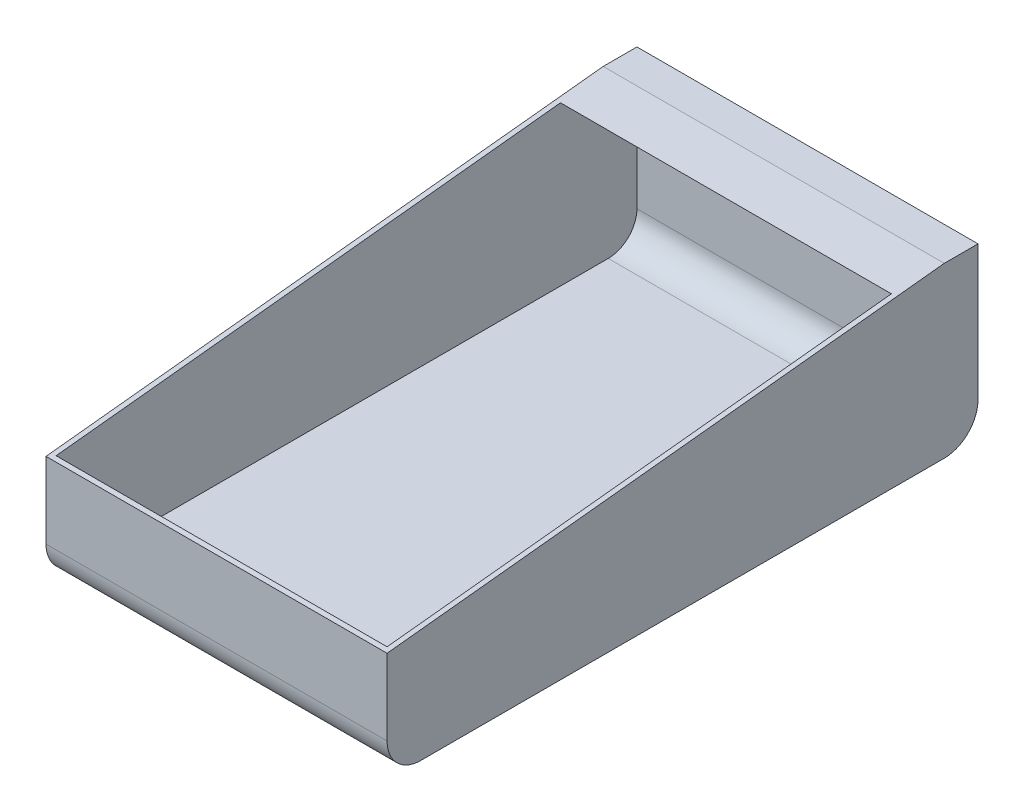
from build123d import *

# Parameters (mm, degrees)
SKETCH1_W           = 202
SKETCH1_H           = 350
BOSS_EXTRUDE1_DEPTH = 100
CHAMFER1_SIZE       = 35
CHAMFER1_SIZE2      = 330
FILLET1_R           = 20
FILLET2_R           = 20
SHELL2_T            = -3


with BuildPart() as part:
    # Sketch1 → Boss-Extrude1 (new body)
    with BuildSketch(Plane(origin=(0, 0, 0), x_dir=(1, 0, 0), z_dir=(0, 1, 0))):
        Rectangle(SKETCH1_W, SKETCH1_H)
    extrude(amount=BOSS_EXTRUDE1_DEPTH)

    # Chamfer1
    chamfer1_edges = [part.edges().sort_by_distance(p)[0] for p in [
        (0, 100, 175),
    ]]
    chamfer1_side = [part.faces().sort_by_distance(p)[0] for p in [
        (0, 50, 175),
    ]]
    chamfer(chamfer1_edges, length=CHAMFER1_SIZE, length2=CHAMFER1_SIZE2, reference=chamfer1_side[0])

    # Fillet1
    fillet1_edges = [part.edges().sort_by_distance(p)[0] for p in [
        (0, 0, 175),
    ]]
    fillet(fillet1_edges, radius=FILLET1_R)

    # Fillet2
    fillet2_edges = [part.edges().sort_by_distance(p)[0] for p in [
        (0, 0, -175),
    ]]
    fillet(fillet2_edges, radius=FILLET2_R)

    # Shell2
    shell2_openings = [part.faces().sort_by_distance(p)[0] for p in [
        (0, 82.5, 10),
    ]]
    offset(amount=SHELL2_T, openings=shell2_openings, kind=Kind.INTERSECTION)


solid = part.part
